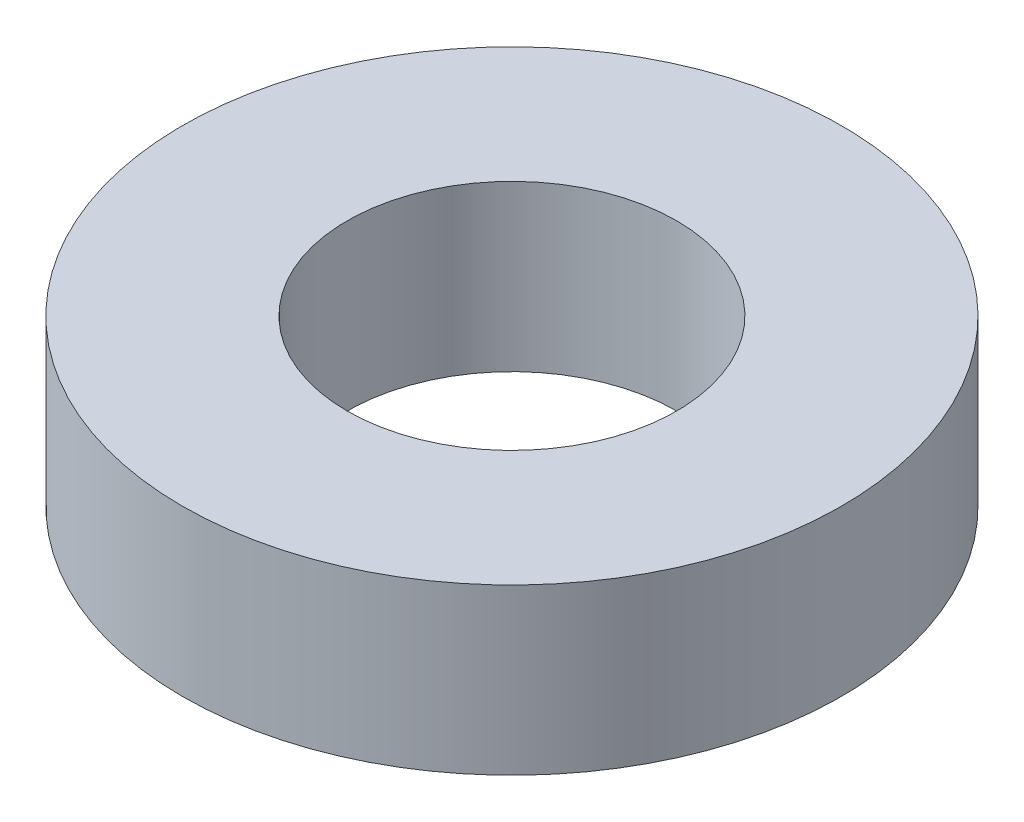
ISO-10303-21;
HEADER;
FILE_DESCRIPTION(('STEP AP214'),'2;1');
FILE_NAME('part.step','',(''),(''),'','','');
FILE_SCHEMA(('AUTOMOTIVE_DESIGN { 1 0 10303 214 1 1 1 1 }'));
ENDSEC;
DATA;
#1=APPLICATION_CONTEXT('core data for automotive mechanical design processes');
#2=APPLICATION_PROTOCOL_DEFINITION('international standard','automotive_design',2000,#1);
#3=PRODUCT_CONTEXT('',#1,'mechanical');
#4=PRODUCT('Part','Part','',(#3));
#5=PRODUCT_RELATED_PRODUCT_CATEGORY('part','',(#4));
#6=PRODUCT_DEFINITION_FORMATION('','',#4);
#7=PRODUCT_DEFINITION_CONTEXT('part definition',#1,'design');
#8=PRODUCT_DEFINITION('design','',#6,#7);
#9=PRODUCT_DEFINITION_SHAPE('','',#8);
#10=(LENGTH_UNIT() NAMED_UNIT(*) SI_UNIT(.MILLI.,.METRE.));
#11=(NAMED_UNIT(*) PLANE_ANGLE_UNIT() SI_UNIT($,.RADIAN.));
#12=(NAMED_UNIT(*) SI_UNIT($,.STERADIAN.) SOLID_ANGLE_UNIT());
#13=UNCERTAINTY_MEASURE_WITH_UNIT(LENGTH_MEASURE(1.E-05),#10,'distance_accuracy_value','');
#14=(GEOMETRIC_REPRESENTATION_CONTEXT(3) GLOBAL_UNCERTAINTY_ASSIGNED_CONTEXT((#13)) GLOBAL_UNIT_ASSIGNED_CONTEXT((#10,
#11,#12)) REPRESENTATION_CONTEXT('',''));
#15=CARTESIAN_POINT('',(0.,0.,0.));
#16=DIRECTION('',(0.,0.,1.));
#17=DIRECTION('',(1.,0.,0.));
#18=AXIS2_PLACEMENT_3D('',#15,#16,#17);
#19=CARTESIAN_POINT('',(0.,5.,0.));
#20=DIRECTION('',(0.,1.,0.));
#21=DIRECTION('',(0.,0.,1.));
#22=AXIS2_PLACEMENT_3D('',#19,#20,#21);
#23=PLANE('',#22);
#24=CARTESIAN_POINT('',(0.,5.,0.));
#25=DIRECTION('',(0.,1.,0.));
#26=DIRECTION('',(0.,0.,1.));
#27=AXIS2_PLACEMENT_3D('',#24,#25,#26);
#28=CIRCLE('',#27,10.);
#29=CARTESIAN_POINT('',(0.,5.,10.));
#30=VERTEX_POINT('',#29);
#31=EDGE_CURVE('E10',#30,#30,#28,.T.);
#32=ORIENTED_EDGE('',*,*,#31,.T.);
#33=EDGE_LOOP('',(#32));
#34=FACE_BOUND('',#33,.T.);
#35=CARTESIAN_POINT('',(0.,5.,0.));
#36=DIRECTION('',(0.,1.,0.));
#37=DIRECTION('',(0.,0.,1.));
#38=AXIS2_PLACEMENT_3D('',#35,#36,#37);
#39=CIRCLE('',#38,5.);
#40=CARTESIAN_POINT('',(0.,5.,5.));
#41=VERTEX_POINT('',#40);
#42=EDGE_CURVE('E43',#41,#41,#39,.T.);
#43=ORIENTED_EDGE('',*,*,#42,.F.);
#44=EDGE_LOOP('',(#43));
#45=FACE_BOUND('',#44,.T.);
#46=ADVANCED_FACE('F32',(#34,#45),#23,.T.);
#47=CARTESIAN_POINT('',(0.,0.,0.));
#48=DIRECTION('',(0.,1.,0.));
#49=DIRECTION('',(0.,0.,1.));
#50=AXIS2_PLACEMENT_3D('',#47,#48,#49);
#51=PLANE('',#50);
#52=CARTESIAN_POINT('',(0.,0.,0.));
#53=DIRECTION('',(0.,1.,0.));
#54=DIRECTION('',(0.,0.,1.));
#55=AXIS2_PLACEMENT_3D('',#52,#53,#54);
#56=CIRCLE('',#55,10.);
#57=CARTESIAN_POINT('',(0.,0.,10.));
#58=VERTEX_POINT('',#57);
#59=EDGE_CURVE('E36',#58,#58,#56,.T.);
#60=ORIENTED_EDGE('',*,*,#59,.F.);
#61=EDGE_LOOP('',(#60));
#62=FACE_BOUND('',#61,.T.);
#63=CARTESIAN_POINT('',(0.,0.,0.));
#64=DIRECTION('',(0.,1.,0.));
#65=DIRECTION('',(0.,0.,1.));
#66=AXIS2_PLACEMENT_3D('',#63,#64,#65);
#67=CIRCLE('',#66,5.);
#68=CARTESIAN_POINT('',(0.,0.,5.));
#69=VERTEX_POINT('',#68);
#70=EDGE_CURVE('E45',#69,#69,#67,.T.);
#71=ORIENTED_EDGE('',*,*,#70,.T.);
#72=EDGE_LOOP('',(#71));
#73=FACE_BOUND('',#72,.T.);
#74=ADVANCED_FACE('F55',(#62,#73),#51,.F.);
#75=CARTESIAN_POINT('',(0.,5.,0.));
#76=DIRECTION('',(0.,-1.,0.));
#77=DIRECTION('',(0.,0.,-1.));
#78=AXIS2_PLACEMENT_3D('',#75,#76,#77);
#79=CYLINDRICAL_SURFACE('',#78,10.);
#80=ORIENTED_EDGE('',*,*,#31,.F.);
#81=EDGE_LOOP('',(#80));
#82=FACE_BOUND('',#81,.T.);
#83=ORIENTED_EDGE('',*,*,#59,.T.);
#84=EDGE_LOOP('',(#83));
#85=FACE_BOUND('',#84,.T.);
#86=ADVANCED_FACE('F34',(#82,#85),#79,.T.);
#87=CARTESIAN_POINT('',(0.,5.,0.));
#88=DIRECTION('',(0.,-1.,0.));
#89=DIRECTION('',(0.,0.,-1.));
#90=AXIS2_PLACEMENT_3D('',#87,#88,#89);
#91=CYLINDRICAL_SURFACE('',#90,5.);
#92=ORIENTED_EDGE('',*,*,#42,.T.);
#93=EDGE_LOOP('',(#92));
#94=FACE_BOUND('',#93,.T.);
#95=ORIENTED_EDGE('',*,*,#70,.F.);
#96=EDGE_LOOP('',(#95));
#97=FACE_BOUND('',#96,.T.);
#98=ADVANCED_FACE('F51',(#94,#97),#91,.F.);
#99=CLOSED_SHELL('',(#46,#74,#86,#98));
#100=MANIFOLD_SOLID_BREP('B2',#99);
#101=ADVANCED_BREP_SHAPE_REPRESENTATION('',(#18,#100),#14);
#102=SHAPE_DEFINITION_REPRESENTATION(#9,#101);
ENDSEC;
END-ISO-10303-21;
